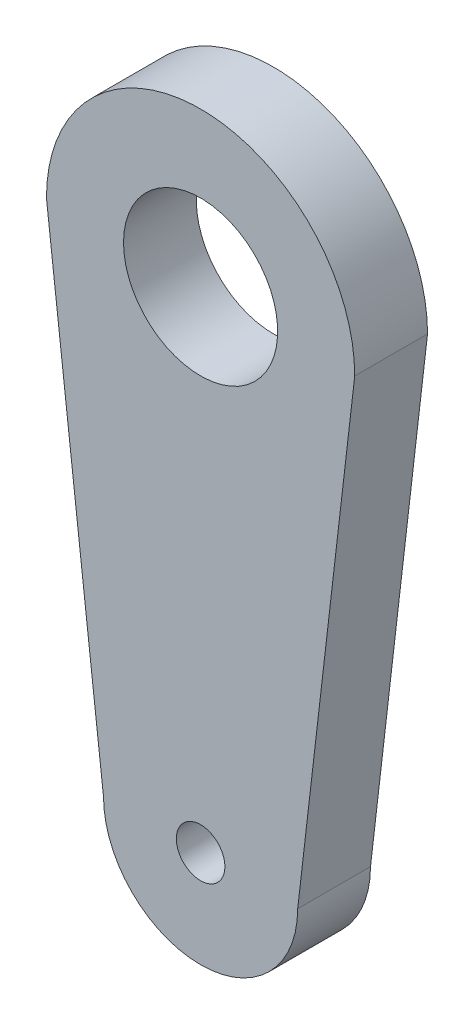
from build123d import *

# Parameters (mm, degrees)
SKETCH1_R           = 3.175
SKETCH1_R_2         = 1.000000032
BOSS_EXTRUDE1_DEPTH = 1.49987


with BuildPart() as part:
    # Sketch1 → Boss-Extrude1 (new, symmetric)
    with BuildSketch(Plane.XY):
        with BuildLine():
            Line((-6.35, 0), (-4.000000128, -20.183654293))
            ThreePointArc((-4.000000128, -20.183654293), (0, -24.183654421), (4.000000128, -20.183654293))
            Line((4.000000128, -20.183654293), (6.35, 0))
            ThreePointArc((6.35, 0), (0, 6.35), (-6.35, 0))
        make_face()
        with Locations(Location((0, 0, 0), (0, 0, 180))):
            Circle(SKETCH1_R, mode=Mode.SUBTRACT)
        with Locations(Location((0, -20.183654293, 0), (0, 0, 180))):
            Circle(SKETCH1_R_2, mode=Mode.SUBTRACT)
    extrude(amount=BOSS_EXTRUDE1_DEPTH, both=True)


solid = part.part
